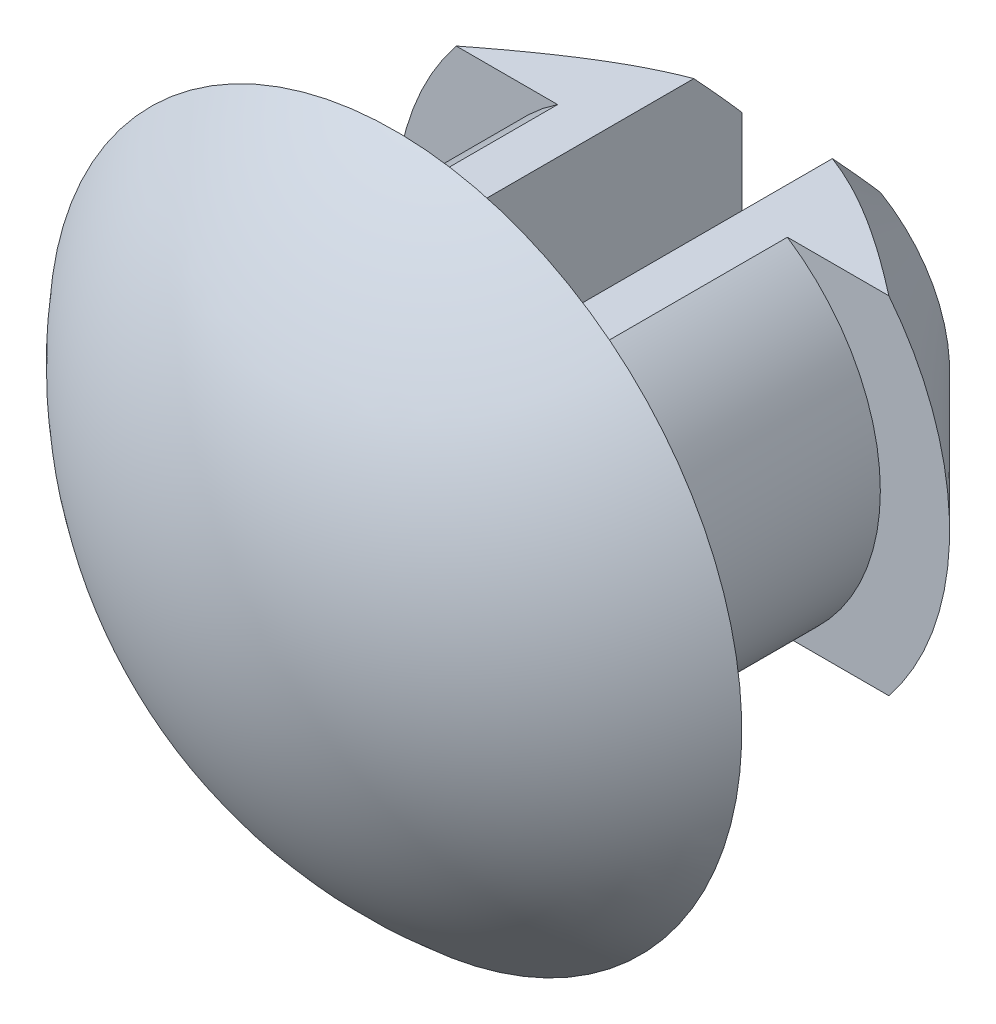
ISO-10303-21;
HEADER;
FILE_DESCRIPTION(('STEP AP214'),'2;1');
FILE_NAME('part.step','',(''),(''),'','','');
FILE_SCHEMA(('AUTOMOTIVE_DESIGN { 1 0 10303 214 1 1 1 1 }'));
ENDSEC;
DATA;
#1=APPLICATION_CONTEXT('core data for automotive mechanical design processes');
#2=APPLICATION_PROTOCOL_DEFINITION('international standard','automotive_design',2000,#1);
#3=PRODUCT_CONTEXT('',#1,'mechanical');
#4=PRODUCT('Part','Part','',(#3));
#5=PRODUCT_RELATED_PRODUCT_CATEGORY('part','',(#4));
#6=PRODUCT_DEFINITION_FORMATION('','',#4);
#7=PRODUCT_DEFINITION_CONTEXT('part definition',#1,'design');
#8=PRODUCT_DEFINITION('design','',#6,#7);
#9=PRODUCT_DEFINITION_SHAPE('','',#8);
#10=(LENGTH_UNIT() NAMED_UNIT(*) SI_UNIT(.MILLI.,.METRE.));
#11=(NAMED_UNIT(*) PLANE_ANGLE_UNIT() SI_UNIT($,.RADIAN.));
#12=(NAMED_UNIT(*) SI_UNIT($,.STERADIAN.) SOLID_ANGLE_UNIT());
#13=UNCERTAINTY_MEASURE_WITH_UNIT(LENGTH_MEASURE(1.E-05),#10,'distance_accuracy_value','');
#14=(GEOMETRIC_REPRESENTATION_CONTEXT(3) GLOBAL_UNCERTAINTY_ASSIGNED_CONTEXT((#13)) GLOBAL_UNIT_ASSIGNED_CONTEXT((#10,
#11,#12)) REPRESENTATION_CONTEXT('',''));
#15=CARTESIAN_POINT('',(0.,0.,0.));
#16=DIRECTION('',(0.,0.,1.));
#17=DIRECTION('',(1.,0.,0.));
#18=AXIS2_PLACEMENT_3D('',#15,#16,#17);
#19=CARTESIAN_POINT('',(-1.,0.,-3.));
#20=DIRECTION('',(0.,0.,-1.));
#21=DIRECTION('',(-1.,0.,0.));
#22=AXIS2_PLACEMENT_3D('',#19,#20,#21);
#23=PLANE('',#22);
#24=DIRECTION('',(0.,1.,0.));
#25=VECTOR('',#24,1.);
#26=CARTESIAN_POINT('',(0.5,-2.5,-3.));
#27=LINE('',#26,#25);
#28=CARTESIAN_POINT('',(0.5,-0.866025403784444,-3.));
#29=VERTEX_POINT('',#28);
#30=CARTESIAN_POINT('',(0.5,0.866025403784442,-3.));
#31=VERTEX_POINT('',#30);
#32=EDGE_CURVE('E175',#29,#31,#27,.T.);
#33=ORIENTED_EDGE('',*,*,#32,.T.);
#34=CARTESIAN_POINT('',(0.,0.,-3.));
#35=DIRECTION('',(0.,0.,-1.));
#36=DIRECTION('',(-1.,0.,0.));
#37=AXIS2_PLACEMENT_3D('',#34,#35,#36);
#38=CIRCLE('',#37,1.);
#39=EDGE_CURVE('E168',#31,#29,#38,.T.);
#40=ORIENTED_EDGE('',*,*,#39,.T.);
#41=EDGE_LOOP('',(#33,#40));
#42=FACE_BOUND('',#41,.T.);
#43=ADVANCED_FACE('F33',(#42),#23,.T.);
#44=CARTESIAN_POINT('',(0.,0.,-3.));
#45=DIRECTION('',(0.,0.,1.));
#46=DIRECTION('',(1.,0.,0.));
#47=AXIS2_PLACEMENT_3D('',#44,#45,#46);
#48=CONICAL_SURFACE('',#47,1.,0.785398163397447);
#49=CARTESIAN_POINT('',(-0.581865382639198,-1.25,-2.62120802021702));
#50=CARTESIAN_POINT('',(-0.539130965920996,-1.25,-2.63924413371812));
#51=CARTESIAN_POINT('',(-0.495759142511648,-1.25,-2.65591424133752));
#52=CARTESIAN_POINT('',(-0.407710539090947,-1.25,-2.68584245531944));
#53=CARTESIAN_POINT('',(-0.363030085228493,-1.25,-2.69908967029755));
#54=CARTESIAN_POINT('',(-0.273411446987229,-1.25,-2.72117059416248));
#55=CARTESIAN_POINT('',(-0.228492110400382,-1.25,-2.73007888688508));
#56=CARTESIAN_POINT('',(-0.138017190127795,-1.25,-2.74319812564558));
#57=CARTESIAN_POINT('',(-0.0924625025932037,-1.25,-2.74741512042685));
#58=CARTESIAN_POINT('',(-0.0035039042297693,-1.25,-2.7507447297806));
#59=CARTESIAN_POINT('',(0.0398905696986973,-1.25,-2.75010788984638));
#60=CARTESIAN_POINT('',(0.126393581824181,-1.25,-2.74436812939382));
#61=CARTESIAN_POINT('',(0.169502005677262,-1.25,-2.7392635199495));
#62=CARTESIAN_POINT('',(0.255061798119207,-1.25,-2.72494184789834));
#63=CARTESIAN_POINT('',(0.2975124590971,-1.25,-2.71572063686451));
#64=CARTESIAN_POINT('',(0.381464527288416,-1.25,-2.69371769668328));
#65=CARTESIAN_POINT('',(0.422965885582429,-1.25,-2.68093578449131));
#66=CARTESIAN_POINT('',(0.544817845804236,-1.25,-2.63854295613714));
#67=CARTESIAN_POINT('',(0.623676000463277,-1.25,-2.60465885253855));
#68=CARTESIAN_POINT('',(0.77771680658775,-1.25,-2.5293506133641));
#69=CARTESIAN_POINT('',(0.85289211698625,-1.25,-2.48791213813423));
#70=CARTESIAN_POINT('',(1.00139418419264,-1.25,-2.39947204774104));
#71=CARTESIAN_POINT('',(1.07467603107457,-1.25,-2.35239602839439));
#72=CARTESIAN_POINT('',(1.21896140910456,-1.25,-2.25485100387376));
#73=CARTESIAN_POINT('',(1.28996390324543,-1.25,-2.20438048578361));
#74=CARTESIAN_POINT('',(1.42599167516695,-1.25,-2.10422332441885));
#75=CARTESIAN_POINT('',(1.49111871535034,-1.25,-2.05467393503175));
#76=CARTESIAN_POINT('',(1.6201907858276,-1.25,-1.95405473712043));
#77=CARTESIAN_POINT('',(1.68413571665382,-1.25,-1.90298480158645));
#78=CARTESIAN_POINT('',(1.87468062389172,-1.25,-1.74802029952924));
#79=CARTESIAN_POINT('',(1.99990378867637,-1.25,-1.6424367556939));
#80=CARTESIAN_POINT('',(2.24122515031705,-1.25,-1.43443853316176));
#81=CARTESIAN_POINT('',(2.35744771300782,-1.25,-1.33216659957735));
#82=CARTESIAN_POINT('',(2.5306113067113,-1.25,-1.17762119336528));
#83=CARTESIAN_POINT('',(2.58809548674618,-1.25,-1.12595500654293));
#84=CARTESIAN_POINT('',(2.70275638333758,-1.25,-1.02228342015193));
#85=CARTESIAN_POINT('',(2.75993310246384,-1.25,-0.970278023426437));
#86=CARTESIAN_POINT('',(2.81698318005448,-1.25,-0.918134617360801));
#87=B_SPLINE_CURVE_WITH_KNOTS('',3,(#49,#50,#51,#52,#53,#54,#55,#56,#57,#58,#59,#60,#61,#62,#63,
#64,#65,#66,#67,#68,#69,#70,#71,#72,#73,#74,#75,#76,#77,#78,#79,#80,#81,#82,#83,#84,#85,#86),
.UNSPECIFIED.,.F.,.F.,(4,2,2,2,2,2,2,2,2,2,2,2,2,2,2,2,2,2,4),(0.,0.139214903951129,
0.278867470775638,0.416026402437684,0.553008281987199,0.682969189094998,0.812979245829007,
0.943120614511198,1.07326867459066,1.33005769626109,1.58733932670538,1.84849691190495,
2.10977167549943,2.35524208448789,2.60073305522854,3.09204169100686,3.55646598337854,
3.78833627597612,4.0202046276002),.UNSPECIFIED.);
#88=CARTESIAN_POINT('',(0.5,-1.25,-2.65370879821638));
#89=VERTEX_POINT('',#88);
#90=CARTESIAN_POINT('',(1.56124949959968,-1.25,-1.99999999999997));
#91=VERTEX_POINT('',#90);
#92=EDGE_CURVE('E183',#89,#91,#87,.T.);
#93=ORIENTED_EDGE('',*,*,#92,.F.);
#94=CARTESIAN_POINT('',(0.5,4.44603678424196,0.474063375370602));
#95=CARTESIAN_POINT('',(0.5,4.32272067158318,0.351522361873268));
#96=CARTESIAN_POINT('',(0.5,4.1993752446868,0.2290108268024));
#97=CARTESIAN_POINT('',(0.5,3.95257998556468,-0.0159496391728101));
#98=CARTESIAN_POINT('',(0.5,3.82913013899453,-0.138398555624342));
#99=CARTESIAN_POINT('',(0.5,3.58165551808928,-0.383650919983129));
#100=CARTESIAN_POINT('',(0.5,3.45763033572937,-0.506453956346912));
#101=CARTESIAN_POINT('',(0.5,3.20945063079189,-0.751886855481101));
#102=CARTESIAN_POINT('',(0.5,3.08529613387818,-0.874516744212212));
#103=CARTESIAN_POINT('',(0.5,2.77363505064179,-1.18183594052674));
#104=CARTESIAN_POINT('',(0.5,2.58599766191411,-1.36639287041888));
#105=CARTESIAN_POINT('',(0.5,2.3038268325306,-1.64261591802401));
#106=CARTESIAN_POINT('',(0.5,2.20962124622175,-1.73461683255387));
#107=CARTESIAN_POINT('',(0.5,2.02089626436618,-1.91828316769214));
#108=CARTESIAN_POINT('',(0.5,1.92637689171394,-2.00994861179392));
#109=CARTESIAN_POINT('',(0.5,1.73718945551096,-2.19245762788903));
#110=CARTESIAN_POINT('',(0.5,1.64252308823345,-2.28330295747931));
#111=CARTESIAN_POINT('',(0.5,1.45240520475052,-2.46422396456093));
#112=CARTESIAN_POINT('',(0.5,1.3569534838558,-2.55429942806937));
#113=CARTESIAN_POINT('',(0.5,1.21282012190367,-2.68827322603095));
#114=CARTESIAN_POINT('',(0.5,1.16464480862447,-2.73271561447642));
#115=CARTESIAN_POINT('',(0.5,1.06782166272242,-2.8210819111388));
#116=CARTESIAN_POINT('',(0.5,1.01917384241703,-2.86500583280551));
#117=CARTESIAN_POINT('',(0.5,0.921222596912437,-2.95207448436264));
#118=CARTESIAN_POINT('',(0.5,0.871919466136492,-2.99521954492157));
#119=CARTESIAN_POINT('',(0.5,0.772311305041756,-3.08033382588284));
#120=CARTESIAN_POINT('',(0.5,0.722006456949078,-3.12230325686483));
#121=CARTESIAN_POINT('',(0.5,0.651493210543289,-3.17883488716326));
#122=CARTESIAN_POINT('',(0.5,0.631969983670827,-3.19425057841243));
#123=CARTESIAN_POINT('',(0.5,0.592637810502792,-3.22471676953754));
#124=CARTESIAN_POINT('',(0.5,0.572828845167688,-3.23976724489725));
#125=CARTESIAN_POINT('',(0.5,0.532816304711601,-3.26944397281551));
#126=CARTESIAN_POINT('',(0.5,0.512611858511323,-3.28406905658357));
#127=CARTESIAN_POINT('',(0.5,0.471778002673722,-3.31271200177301));
#128=CARTESIAN_POINT('',(0.5,0.451148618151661,-3.32672989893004));
#129=CARTESIAN_POINT('',(0.5,0.389725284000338,-3.36681225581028));
#130=CARTESIAN_POINT('',(0.5,0.348219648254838,-3.39180283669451));
#131=CARTESIAN_POINT('',(0.5,0.262471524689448,-3.43647040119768));
#132=CARTESIAN_POINT('',(0.5,0.218243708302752,-3.45617324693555));
#133=CARTESIAN_POINT('',(0.5,0.157915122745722,-3.47583301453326));
#134=CARTESIAN_POINT('',(0.5,0.143227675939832,-3.48008694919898));
#135=CARTESIAN_POINT('',(0.5,0.113571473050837,-3.48746653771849));
#136=CARTESIAN_POINT('',(0.5,0.0986026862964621,-3.49059206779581));
#137=CARTESIAN_POINT('',(0.5,0.0535018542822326,-3.49800886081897));
#138=CARTESIAN_POINT('',(0.5,0.0230197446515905,-3.50039411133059));
#139=CARTESIAN_POINT('',(0.5,-0.0379114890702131,-3.49949501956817));
#140=CARTESIAN_POINT('',(0.5,-0.0683603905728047,-3.49619810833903));
#141=CARTESIAN_POINT('',(0.5,-0.128387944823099,-3.4846307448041));
#142=CARTESIAN_POINT('',(0.5,-0.157961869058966,-3.47633713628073));
#143=CARTESIAN_POINT('',(0.5,-0.219675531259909,-3.45474025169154));
#144=CARTESIAN_POINT('',(0.5,-0.251624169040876,-3.44091259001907));
#145=CARTESIAN_POINT('',(0.5,-0.314035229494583,-3.41018769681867));
#146=CARTESIAN_POINT('',(0.5,-0.344494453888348,-3.39328419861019));
#147=CARTESIAN_POINT('',(0.5,-0.404423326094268,-3.3573648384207));
#148=CARTESIAN_POINT('',(0.5,-0.433884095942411,-3.3383344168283));
#149=CARTESIAN_POINT('',(0.5,-0.491854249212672,-3.29895083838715));
#150=CARTESIAN_POINT('',(0.5,-0.520364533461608,-3.27859899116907));
#151=CARTESIAN_POINT('',(0.5,-0.57953638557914,-3.23486869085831));
#152=CARTESIAN_POINT('',(0.5,-0.610124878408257,-3.21139201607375));
#153=CARTESIAN_POINT('',(0.5,-0.670685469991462,-3.16365409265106));
#154=CARTESIAN_POINT('',(0.5,-0.700657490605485,-3.13939274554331));
#155=CARTESIAN_POINT('',(0.5,-0.789910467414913,-3.06575429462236));
#156=CARTESIAN_POINT('',(0.5,-0.848501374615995,-3.01554338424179));
#157=CARTESIAN_POINT('',(0.5,-0.964681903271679,-2.9137964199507));
#158=CARTESIAN_POINT('',(0.5,-1.02226967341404,-2.86225827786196));
#159=CARTESIAN_POINT('',(0.5,-1.13671607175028,-2.7584099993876));
#160=CARTESIAN_POINT('',(0.5,-1.19357488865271,-2.7061000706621));
#161=CARTESIAN_POINT('',(0.5,-1.30660824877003,-2.60114748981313));
#162=CARTESIAN_POINT('',(0.5,-1.36278450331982,-2.54850667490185));
#163=CARTESIAN_POINT('',(0.5,-1.47479874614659,-2.44285929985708));
#164=CARTESIAN_POINT('',(0.5,-1.53063671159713,-2.38985271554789));
#165=CARTESIAN_POINT('',(0.5,-1.69767409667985,-2.2305469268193));
#166=CARTESIAN_POINT('',(0.5,-1.80850445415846,-2.12386109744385));
#167=CARTESIAN_POINT('',(0.5,-2.02526052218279,-1.91410009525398));
#168=CARTESIAN_POINT('',(0.5,-2.13120809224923,-1.81104744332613));
#169=CARTESIAN_POINT('',(0.5,-2.34276011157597,-1.60458875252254));
#170=CARTESIAN_POINT('',(0.5,-2.44836455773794,-1.50118271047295));
#171=CARTESIAN_POINT('',(0.5,-2.76491471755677,-1.19053612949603));
#172=CARTESIAN_POINT('',(0.5,-2.97551665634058,-0.982945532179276));
#173=CARTESIAN_POINT('',(0.5,-3.39630757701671,-0.567237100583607));
#174=CARTESIAN_POINT('',(0.5,-3.60649643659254,-0.359119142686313));
#175=CARTESIAN_POINT('',(0.5,-4.02649035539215,0.0573323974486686));
#176=CARTESIAN_POINT('',(0.5,-4.23629553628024,0.265665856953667));
#177=CARTESIAN_POINT('',(0.5,-4.44603678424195,0.474063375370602));
#178=B_SPLINE_CURVE_WITH_KNOTS('',3,(#94,#95,#96,#97,#98,#99,#100,#101,#102,#103,#104,#105,#106,
#107,#108,#109,#110,#111,#112,#113,#114,#115,#116,#117,#118,#119,#120,#121,#122,#123,#124,#125,
#126,#127,#128,#129,#130,#131,#132,#133,#134,#135,#136,#137,#138,#139,#140,#141,#142,#143,#144,
#145,#146,#147,#148,#149,#150,#151,#152,#153,#154,#155,#156,#157,#158,#159,#160,#161,#162,#163,
#164,#165,#166,#167,#168,#169,#170,#171,#172,#173,#174,#175,#176,#177),.UNSPECIFIED.,.F.,.F.,(4,
2,2,2,2,2,2,2,2,2,2,2,2,2,2,2,2,2,2,2,2,2,2,2,2,2,2,2,2,2,2,2,2,2,2,2,2,2,2,2,2,4),(0.,
0.521544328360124,1.04317866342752,1.56678666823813,2.09030537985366,2.87987371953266,
3.27490459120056,3.66990724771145,4.06351864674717,4.45723610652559,4.65386510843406,
4.85048899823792,5.04702734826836,5.24353026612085,5.31815399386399,5.3927827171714,
5.46760012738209,5.5424131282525,5.68761009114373,5.83208339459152,5.87791587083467,
5.9237533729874,6.01494038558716,6.10632936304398,6.19814515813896,6.30233063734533,
6.40673080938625,6.51189534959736,6.61695720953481,6.73261636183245,6.84829008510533,
7.07973925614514,7.31157799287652,7.54335544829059,7.77431114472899,8.00528225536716,
8.46678294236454,8.9101810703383,9.35358319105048,10.2407247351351,11.1280981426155,
12.0151092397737),.UNSPECIFIED.);
#179=EDGE_CURVE('E155',#29,#89,#178,.T.);
#180=ORIENTED_EDGE('',*,*,#179,.F.);
#181=ORIENTED_EDGE('',*,*,#39,.F.);
#182=CARTESIAN_POINT('',(0.5,1.25,-2.65370879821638));
#183=VERTEX_POINT('',#182);
#184=EDGE_CURVE('E181',#183,#31,#178,.T.);
#185=ORIENTED_EDGE('',*,*,#184,.F.);
#186=CARTESIAN_POINT('',(2.81698318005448,1.25,-0.918134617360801));
#187=CARTESIAN_POINT('',(2.73518486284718,1.25,-0.992880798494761));
#188=CARTESIAN_POINT('',(2.65313828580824,1.25,-1.06735942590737));
#189=CARTESIAN_POINT('',(2.48834532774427,1.25,-1.21557369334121));
#190=CARTESIAN_POINT('',(2.40559879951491,1.25,-1.28930916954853));
#191=CARTESIAN_POINT('',(2.23884641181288,1.25,-1.43614143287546));
#192=CARTESIAN_POINT('',(2.15483645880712,1.25,-1.50923358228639));
#193=CARTESIAN_POINT('',(1.98566373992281,1.25,-1.65405866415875));
#194=CARTESIAN_POINT('',(1.90050109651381,1.25,-1.72579173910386));
#195=CARTESIAN_POINT('',(1.74436661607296,1.25,-1.85436897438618));
#196=CARTESIAN_POINT('',(1.67365708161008,1.25,-1.91153070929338));
#197=CARTESIAN_POINT('',(1.53086849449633,1.25,-2.02411397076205));
#198=CARTESIAN_POINT('',(1.45878955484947,1.25,-2.07953563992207));
#199=CARTESIAN_POINT('',(1.31281586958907,1.25,-2.18793215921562));
#200=CARTESIAN_POINT('',(1.2389213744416,1.25,-2.24090734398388));
#201=CARTESIAN_POINT('',(1.08870639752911,1.25,-2.34326903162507));
#202=CARTESIAN_POINT('',(1.0123869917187,1.25,-2.39265709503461));
#203=CARTESIAN_POINT('',(0.849758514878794,1.25,-2.4900438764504));
#204=CARTESIAN_POINT('',(0.763154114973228,1.25,-2.53755997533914));
#205=CARTESIAN_POINT('',(0.584966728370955,1.25,-2.62211790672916));
#206=CARTESIAN_POINT('',(0.493395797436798,1.25,-2.65918385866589));
#207=CARTESIAN_POINT('',(0.32691010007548,1.25,-2.70976682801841));
#208=CARTESIAN_POINT('',(0.253111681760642,1.25,-2.72676467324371));
#209=CARTESIAN_POINT('',(0.141126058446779,1.25,-2.7426064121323));
#210=CARTESIAN_POINT('',(0.103602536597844,1.25,-2.74627841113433));
#211=CARTESIAN_POINT('',(0.0283722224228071,1.25,-2.75024054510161));
#212=CARTESIAN_POINT('',(-0.00933455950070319,1.25,-2.75053086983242));
#213=CARTESIAN_POINT('',(-0.0846347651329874,1.25,-2.74770370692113));
#214=CARTESIAN_POINT('',(-0.122228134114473,1.25,-2.74458477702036));
#215=CARTESIAN_POINT('',(-0.197011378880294,1.25,-2.73511487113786));
#216=CARTESIAN_POINT('',(-0.23420103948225,1.25,-2.72876225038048));
#217=CARTESIAN_POINT('',(-0.344934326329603,1.25,-2.70528692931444));
#218=CARTESIAN_POINT('',(-0.417572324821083,1.25,-2.68375034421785));
#219=CARTESIAN_POINT('',(-0.504239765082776,1.25,-2.65220907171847));
#220=CARTESIAN_POINT('',(-0.519899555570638,1.25,-2.64626851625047));
#221=CARTESIAN_POINT('',(-0.551017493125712,1.25,-2.63401397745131));
#222=CARTESIAN_POINT('',(-0.566476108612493,1.25,-2.62770118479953));
#223=CARTESIAN_POINT('',(-0.581865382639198,1.25,-2.62120802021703));
#224=B_SPLINE_CURVE_WITH_KNOTS('',3,(#186,#187,#188,#189,#190,#191,#192,#193,#194,#195,#196,
#197,#198,#199,#200,#201,#202,#203,#204,#205,#206,#207,#208,#209,#210,#211,#212,#213,#214,#215,
#216,#217,#218,#219,#220,#221,#222,#223),.UNSPECIFIED.,.F.,.F.,(4,2,2,2,2,2,2,2,2,2,2,2,2,2,2,2,
2,2,4),(0.,0.332421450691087,0.664914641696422,0.998972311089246,1.3329947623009,
1.60574959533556,1.87848201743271,2.15117702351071,2.42375267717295,2.71971079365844,
3.01498012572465,3.24115831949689,3.35413093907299,3.46709721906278,3.5801113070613,
3.69318293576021,3.91953377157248,3.96978161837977,4.01987664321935),.UNSPECIFIED.);
#225=CARTESIAN_POINT('',(1.56124949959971,1.25,-1.99999999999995));
#226=VERTEX_POINT('',#225);
#227=EDGE_CURVE('E48',#226,#183,#224,.T.);
#228=ORIENTED_EDGE('',*,*,#227,.F.);
#229=CARTESIAN_POINT('',(0.,0.,-2.));
#230=DIRECTION('',(0.,0.,-1.));
#231=DIRECTION('',(-1.,0.,0.));
#232=AXIS2_PLACEMENT_3D('',#229,#230,#231);
#233=CIRCLE('',#232,2.);
#234=EDGE_CURVE('E163',#226,#91,#233,.T.);
#235=ORIENTED_EDGE('',*,*,#234,.T.);
#236=EDGE_LOOP('',(#93,#180,#181,#185,#228,#235));
#237=FACE_BOUND('',#236,.T.);
#238=ADVANCED_FACE('F180',(#237),#48,.T.);
#239=CARTESIAN_POINT('',(-1.5,0.,-2.));
#240=DIRECTION('',(0.,0.,1.));
#241=DIRECTION('',(1.,0.,0.));
#242=AXIS2_PLACEMENT_3D('',#239,#240,#241);
#243=PLANE('',#242);
#244=DIRECTION('',(-1.,0.,0.));
#245=VECTOR('',#244,1.);
#246=CARTESIAN_POINT('',(-1.5,-1.25,-2.));
#247=LINE('',#246,#245);
#248=CARTESIAN_POINT('',(0.829156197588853,-1.25,-2.));
#249=VERTEX_POINT('',#248);
#250=EDGE_CURVE('E257',#91,#249,#247,.T.);
#251=ORIENTED_EDGE('',*,*,#250,.F.);
#252=ORIENTED_EDGE('',*,*,#234,.F.);
#253=DIRECTION('',(1.,0.,0.));
#254=VECTOR('',#253,1.);
#255=CARTESIAN_POINT('',(-1.5,1.25,-2.));
#256=LINE('',#255,#254);
#257=CARTESIAN_POINT('',(0.829156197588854,1.25,-2.));
#258=VERTEX_POINT('',#257);
#259=EDGE_CURVE('E277',#258,#226,#256,.T.);
#260=ORIENTED_EDGE('',*,*,#259,.F.);
#261=CARTESIAN_POINT('',(0.,0.,-2.));
#262=DIRECTION('',(0.,0.,-1.));
#263=DIRECTION('',(-1.,0.,0.));
#264=AXIS2_PLACEMENT_3D('',#261,#262,#263);
#265=CIRCLE('',#264,1.5);
#266=EDGE_CURVE('E159',#258,#249,#265,.T.);
#267=ORIENTED_EDGE('',*,*,#266,.T.);
#268=EDGE_LOOP('',(#251,#252,#260,#267));
#269=FACE_BOUND('',#268,.T.);
#270=ADVANCED_FACE('F222',(#269),#243,.T.);
#271=CARTESIAN_POINT('',(0.,0.,0.));
#272=DIRECTION('',(0.,0.,-1.));
#273=DIRECTION('',(-1.,0.,0.));
#274=AXIS2_PLACEMENT_3D('',#271,#272,#273);
#275=CYLINDRICAL_SURFACE('',#274,1.5);
#276=DIRECTION('',(0.,0.,-1.));
#277=VECTOR('',#276,1.);
#278=CARTESIAN_POINT('',(0.829156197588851,-1.25,0.));
#279=LINE('',#278,#277);
#280=CARTESIAN_POINT('',(0.82915619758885,-1.25,0.));
#281=VERTEX_POINT('',#280);
#282=EDGE_CURVE('E245',#249,#281,#279,.F.);
#283=ORIENTED_EDGE('',*,*,#282,.F.);
#284=ORIENTED_EDGE('',*,*,#266,.F.);
#285=DIRECTION('',(0.,0.,-1.));
#286=VECTOR('',#285,1.);
#287=CARTESIAN_POINT('',(0.829156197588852,1.25,0.));
#288=LINE('',#287,#286);
#289=CARTESIAN_POINT('',(0.829156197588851,1.25,0.));
#290=VERTEX_POINT('',#289);
#291=EDGE_CURVE('E275',#290,#258,#288,.T.);
#292=ORIENTED_EDGE('',*,*,#291,.F.);
#293=CARTESIAN_POINT('',(0.,0.,0.));
#294=DIRECTION('',(0.,0.,-1.));
#295=DIRECTION('',(-1.,0.,0.));
#296=AXIS2_PLACEMENT_3D('',#293,#294,#295);
#297=CIRCLE('',#296,1.5);
#298=EDGE_CURVE('E149',#290,#281,#297,.T.);
#299=ORIENTED_EDGE('',*,*,#298,.T.);
#300=EDGE_LOOP('',(#283,#284,#292,#299));
#301=FACE_BOUND('',#300,.T.);
#302=ADVANCED_FACE('F219',(#301),#275,.T.);
#303=CARTESIAN_POINT('',(0.,0.,-2.07665596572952));
#304=DIRECTION('',(0.,0.,-1.));
#305=DIRECTION('',(-1.,0.,0.));
#306=AXIS2_PLACEMENT_3D('',#303,#304,#305);
#307=SPHERICAL_SURFACE('',#306,3.25);
#308=CARTESIAN_POINT('',(0.,0.,0.));
#309=DIRECTION('',(0.,0.,-1.));
#310=DIRECTION('',(-1.,0.,0.));
#311=AXIS2_PLACEMENT_3D('',#308,#309,#310);
#312=CIRCLE('',#311,2.5);
#313=CARTESIAN_POINT('',(-2.5,0.,0.));
#314=VERTEX_POINT('',#313);
#315=EDGE_CURVE('E150',#314,#314,#312,.T.);
#316=ORIENTED_EDGE('',*,*,#315,.F.);
#317=EDGE_LOOP('',(#316));
#318=FACE_BOUND('',#317,.T.);
#319=ADVANCED_FACE('F35',(#318),#307,.T.);
#320=DIRECTION('',(0.,1.,0.));
#321=VECTOR('',#320,1.);
#322=CARTESIAN_POINT('',(-0.5,-2.5,-3.));
#323=LINE('',#322,#321);
#324=CARTESIAN_POINT('',(-0.5,-0.86602540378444,-3.));
#325=VERTEX_POINT('',#324);
#326=CARTESIAN_POINT('',(-0.5,0.866025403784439,-3.));
#327=VERTEX_POINT('',#326);
#328=EDGE_CURVE('E242',#325,#327,#323,.T.);
#329=ORIENTED_EDGE('',*,*,#328,.F.);
#330=EDGE_CURVE('E166',#325,#327,#38,.T.);
#331=ORIENTED_EDGE('',*,*,#330,.T.);
#332=EDGE_LOOP('',(#329,#331));
#333=FACE_BOUND('',#332,.T.);
#334=ADVANCED_FACE('F226',(#333),#23,.T.);
#335=CARTESIAN_POINT('',(-2.81698318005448,-1.25,-0.918134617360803));
#336=CARTESIAN_POINT('',(-2.73518486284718,-1.25,-0.992880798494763));
#337=CARTESIAN_POINT('',(-2.65313828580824,-1.25,-1.06735942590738));
#338=CARTESIAN_POINT('',(-2.48834532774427,-1.25,-1.21557369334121));
#339=CARTESIAN_POINT('',(-2.40559879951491,-1.25,-1.28930916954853));
#340=CARTESIAN_POINT('',(-2.23884641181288,-1.25,-1.43614143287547));
#341=CARTESIAN_POINT('',(-2.15483645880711,-1.25,-1.50923358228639));
#342=CARTESIAN_POINT('',(-1.9856637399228,-1.25,-1.65405866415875));
#343=CARTESIAN_POINT('',(-1.9005010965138,-1.25,-1.72579173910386));
#344=CARTESIAN_POINT('',(-1.74436661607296,-1.25,-1.85436897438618));
#345=CARTESIAN_POINT('',(-1.67365708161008,-1.25,-1.91153070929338));
#346=CARTESIAN_POINT('',(-1.53086849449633,-1.25,-2.02411397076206));
#347=CARTESIAN_POINT('',(-1.45878955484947,-1.25,-2.07953563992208));
#348=CARTESIAN_POINT('',(-1.31281586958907,-1.25,-2.18793215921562));
#349=CARTESIAN_POINT('',(-1.2389213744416,-1.25,-2.24090734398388));
#350=CARTESIAN_POINT('',(-1.0887063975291,-1.25,-2.34326903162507));
#351=CARTESIAN_POINT('',(-1.0123869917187,-1.25,-2.39265709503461));
#352=CARTESIAN_POINT('',(-0.84975851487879,-1.25,-2.4900438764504));
#353=CARTESIAN_POINT('',(-0.763154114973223,-1.25,-2.53755997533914));
#354=CARTESIAN_POINT('',(-0.584966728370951,-1.25,-2.62211790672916));
#355=CARTESIAN_POINT('',(-0.493395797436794,-1.25,-2.65918385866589));
#356=CARTESIAN_POINT('',(-0.326910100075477,-1.25,-2.70976682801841));
#357=CARTESIAN_POINT('',(-0.253111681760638,-1.25,-2.72676467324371));
#358=CARTESIAN_POINT('',(-0.141126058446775,-1.25,-2.7426064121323));
#359=CARTESIAN_POINT('',(-0.103602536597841,-1.25,-2.74627841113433));
#360=CARTESIAN_POINT('',(-0.0283722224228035,-1.25,-2.75024054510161));
#361=CARTESIAN_POINT('',(0.00933455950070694,-1.25,-2.75053086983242));
#362=CARTESIAN_POINT('',(0.0846347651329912,-1.25,-2.74770370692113));
#363=CARTESIAN_POINT('',(0.122228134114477,-1.25,-2.74458477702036));
#364=CARTESIAN_POINT('',(0.197011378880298,-1.25,-2.73511487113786));
#365=CARTESIAN_POINT('',(0.234201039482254,-1.25,-2.72876225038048));
#366=CARTESIAN_POINT('',(0.344934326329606,-1.25,-2.70528692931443));
#367=CARTESIAN_POINT('',(0.417572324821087,-1.25,-2.68375034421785));
#368=CARTESIAN_POINT('',(0.504239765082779,-1.25,-2.65220907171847));
#369=CARTESIAN_POINT('',(0.519899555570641,-1.25,-2.64626851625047));
#370=CARTESIAN_POINT('',(0.551017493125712,-1.25,-2.63401397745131));
#371=CARTESIAN_POINT('',(0.566476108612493,-1.25,-2.62770118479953));
#372=CARTESIAN_POINT('',(0.581865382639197,-1.25,-2.62120802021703));
#373=B_SPLINE_CURVE_WITH_KNOTS('',3,(#335,#336,#337,#338,#339,#340,#341,#342,#343,#344,#345,
#346,#347,#348,#349,#350,#351,#352,#353,#354,#355,#356,#357,#358,#359,#360,#361,#362,#363,#364,
#365,#366,#367,#368,#369,#370,#371,#372),.UNSPECIFIED.,.F.,.F.,(4,2,2,2,2,2,2,2,2,2,2,2,2,2,2,2,
2,2,4),(0.,0.332421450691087,0.664914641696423,0.998972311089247,1.33299476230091,
1.60574959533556,1.87848201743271,2.15117702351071,2.42375267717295,2.71971079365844,
3.01498012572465,3.24115831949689,3.35413093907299,3.46709721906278,3.5801113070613,
3.69318293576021,3.91953377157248,3.96978161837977,4.01987664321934),.UNSPECIFIED.);
#374=CARTESIAN_POINT('',(-1.56124949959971,-1.25,-1.99999999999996));
#375=VERTEX_POINT('',#374);
#376=CARTESIAN_POINT('',(-0.5,-1.25,-2.65370879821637));
#377=VERTEX_POINT('',#376);
#378=EDGE_CURVE('E269',#375,#377,#373,.T.);
#379=ORIENTED_EDGE('',*,*,#378,.F.);
#380=CARTESIAN_POINT('',(-1.56124949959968,1.25,-1.99999999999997));
#381=VERTEX_POINT('',#380);
#382=EDGE_CURVE('E162',#375,#381,#233,.T.);
#383=ORIENTED_EDGE('',*,*,#382,.T.);
#384=CARTESIAN_POINT('',(0.581865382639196,1.25,-2.62120802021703));
#385=CARTESIAN_POINT('',(0.539130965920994,1.25,-2.63924413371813));
#386=CARTESIAN_POINT('',(0.495759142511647,1.25,-2.65591424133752));
#387=CARTESIAN_POINT('',(0.407710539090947,1.25,-2.68584245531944));
#388=CARTESIAN_POINT('',(0.363030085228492,1.25,-2.69908967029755));
#389=CARTESIAN_POINT('',(0.273411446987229,1.25,-2.72117059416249));
#390=CARTESIAN_POINT('',(0.228492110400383,1.25,-2.73007888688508));
#391=CARTESIAN_POINT('',(0.138017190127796,1.25,-2.74319812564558));
#392=CARTESIAN_POINT('',(0.0924625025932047,1.25,-2.74741512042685));
#393=CARTESIAN_POINT('',(0.00350390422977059,1.25,-2.7507447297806));
#394=CARTESIAN_POINT('',(-0.0398905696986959,1.25,-2.75010788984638));
#395=CARTESIAN_POINT('',(-0.126393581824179,1.25,-2.74436812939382));
#396=CARTESIAN_POINT('',(-0.169502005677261,1.25,-2.7392635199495));
#397=CARTESIAN_POINT('',(-0.255061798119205,1.25,-2.72494184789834));
#398=CARTESIAN_POINT('',(-0.297512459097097,1.25,-2.71572063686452));
#399=CARTESIAN_POINT('',(-0.381464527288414,1.25,-2.69371769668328));
#400=CARTESIAN_POINT('',(-0.422965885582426,1.25,-2.68093578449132));
#401=CARTESIAN_POINT('',(-0.544817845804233,1.25,-2.63854295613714));
#402=CARTESIAN_POINT('',(-0.623676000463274,1.25,-2.60465885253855));
#403=CARTESIAN_POINT('',(-0.777716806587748,1.25,-2.5293506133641));
#404=CARTESIAN_POINT('',(-0.852892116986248,1.25,-2.48791213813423));
#405=CARTESIAN_POINT('',(-1.00139418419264,1.25,-2.39947204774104));
#406=CARTESIAN_POINT('',(-1.07467603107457,1.25,-2.35239602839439));
#407=CARTESIAN_POINT('',(-1.21896140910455,1.25,-2.25485100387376));
#408=CARTESIAN_POINT('',(-1.28996390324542,1.25,-2.20438048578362));
#409=CARTESIAN_POINT('',(-1.42599167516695,1.25,-2.10422332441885));
#410=CARTESIAN_POINT('',(-1.49111871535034,1.25,-2.05467393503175));
#411=CARTESIAN_POINT('',(-1.6201907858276,1.25,-1.95405473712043));
#412=CARTESIAN_POINT('',(-1.68413571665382,1.25,-1.90298480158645));
#413=CARTESIAN_POINT('',(-1.87468062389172,1.25,-1.74802029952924));
#414=CARTESIAN_POINT('',(-1.99990378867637,1.25,-1.6424367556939));
#415=CARTESIAN_POINT('',(-2.24122515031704,1.25,-1.43443853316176));
#416=CARTESIAN_POINT('',(-2.35744771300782,1.25,-1.33216659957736));
#417=CARTESIAN_POINT('',(-2.5306113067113,1.25,-1.17762119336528));
#418=CARTESIAN_POINT('',(-2.58809548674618,1.25,-1.12595500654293));
#419=CARTESIAN_POINT('',(-2.70275638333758,1.25,-1.02228342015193));
#420=CARTESIAN_POINT('',(-2.75993310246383,1.25,-0.970278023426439));
#421=CARTESIAN_POINT('',(-2.81698318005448,1.25,-0.918134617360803));
#422=B_SPLINE_CURVE_WITH_KNOTS('',3,(#384,#385,#386,#387,#388,#389,#390,#391,#392,#393,#394,
#395,#396,#397,#398,#399,#400,#401,#402,#403,#404,#405,#406,#407,#408,#409,#410,#411,#412,#413,
#414,#415,#416,#417,#418,#419,#420,#421),.UNSPECIFIED.,.F.,.F.,(4,2,2,2,2,2,2,2,2,2,2,2,2,2,2,2,
2,2,4),(0.,0.139214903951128,0.278867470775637,0.416026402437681,0.553008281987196,
0.682969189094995,0.812979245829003,0.943120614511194,1.07326867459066,1.33005769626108,
1.58733932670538,1.84849691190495,2.10977167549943,2.35524208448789,2.60073305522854,
3.09204169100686,3.55646598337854,3.78833627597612,4.02020462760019),.UNSPECIFIED.);
#423=CARTESIAN_POINT('',(-0.5,1.25,-2.65370879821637));
#424=VERTEX_POINT('',#423);
#425=EDGE_CURVE('E143',#424,#381,#422,.T.);
#426=ORIENTED_EDGE('',*,*,#425,.F.);
#427=CARTESIAN_POINT('',(-0.5,-4.44603678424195,0.474063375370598));
#428=CARTESIAN_POINT('',(-0.5,-4.32272067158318,0.351522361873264));
#429=CARTESIAN_POINT('',(-0.5,-4.1993752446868,0.229010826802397));
#430=CARTESIAN_POINT('',(-0.5,-3.95257998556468,-0.0159496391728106));
#431=CARTESIAN_POINT('',(-0.5,-3.82913013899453,-0.138398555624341));
#432=CARTESIAN_POINT('',(-0.5,-3.58165551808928,-0.383650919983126));
#433=CARTESIAN_POINT('',(-0.5,-3.45763033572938,-0.506453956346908));
#434=CARTESIAN_POINT('',(-0.5,-3.2094506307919,-0.751886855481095));
#435=CARTESIAN_POINT('',(-0.5,-3.08529613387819,-0.874516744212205));
#436=CARTESIAN_POINT('',(-0.5,-2.7736350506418,-1.18183594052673));
#437=CARTESIAN_POINT('',(-0.5,-2.58599766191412,-1.36639287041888));
#438=CARTESIAN_POINT('',(-0.5,-2.3038268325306,-1.64261591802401));
#439=CARTESIAN_POINT('',(-0.5,-2.20962124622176,-1.73461683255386));
#440=CARTESIAN_POINT('',(-0.5,-2.02089626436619,-1.91828316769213));
#441=CARTESIAN_POINT('',(-0.5,-1.92637689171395,-2.00994861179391));
#442=CARTESIAN_POINT('',(-0.5,-1.73718945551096,-2.19245762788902));
#443=CARTESIAN_POINT('',(-0.5,-1.64252308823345,-2.2833029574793));
#444=CARTESIAN_POINT('',(-0.5,-1.45240520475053,-2.46422396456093));
#445=CARTESIAN_POINT('',(-0.5,-1.3569534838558,-2.55429942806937));
#446=CARTESIAN_POINT('',(-0.5,-1.21282012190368,-2.68827322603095));
#447=CARTESIAN_POINT('',(-0.5,-1.16464480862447,-2.73271561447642));
#448=CARTESIAN_POINT('',(-0.5,-1.06782166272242,-2.8210819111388));
#449=CARTESIAN_POINT('',(-0.5,-1.01917384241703,-2.86500583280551));
#450=CARTESIAN_POINT('',(-0.5,-0.921222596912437,-2.95207448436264));
#451=CARTESIAN_POINT('',(-0.5,-0.871919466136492,-2.99521954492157));
#452=CARTESIAN_POINT('',(-0.5,-0.772311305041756,-3.08033382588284));
#453=CARTESIAN_POINT('',(-0.5,-0.722006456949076,-3.12230325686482));
#454=CARTESIAN_POINT('',(-0.5,-0.651493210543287,-3.17883488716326));
#455=CARTESIAN_POINT('',(-0.5,-0.631969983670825,-3.19425057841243));
#456=CARTESIAN_POINT('',(-0.5,-0.59263781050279,-3.22471676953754));
#457=CARTESIAN_POINT('',(-0.5,-0.572828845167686,-3.23976724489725));
#458=CARTESIAN_POINT('',(-0.5,-0.532816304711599,-3.2694439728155));
#459=CARTESIAN_POINT('',(-0.5,-0.512611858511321,-3.28406905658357));
#460=CARTESIAN_POINT('',(-0.5,-0.47177800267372,-3.31271200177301));
#461=CARTESIAN_POINT('',(-0.5,-0.451148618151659,-3.32672989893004));
#462=CARTESIAN_POINT('',(-0.5,-0.389725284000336,-3.36681225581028));
#463=CARTESIAN_POINT('',(-0.5,-0.348219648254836,-3.3918028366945));
#464=CARTESIAN_POINT('',(-0.5,-0.262471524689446,-3.43647040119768));
#465=CARTESIAN_POINT('',(-0.5,-0.21824370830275,-3.45617324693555));
#466=CARTESIAN_POINT('',(-0.5,-0.157915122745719,-3.47583301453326));
#467=CARTESIAN_POINT('',(-0.5,-0.143227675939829,-3.48008694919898));
#468=CARTESIAN_POINT('',(-0.5,-0.113571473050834,-3.48746653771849));
#469=CARTESIAN_POINT('',(-0.5,-0.0986026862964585,-3.49059206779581));
#470=CARTESIAN_POINT('',(-0.5,-0.053501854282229,-3.49800886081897));
#471=CARTESIAN_POINT('',(-0.5,-0.0230197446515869,-3.50039411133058));
#472=CARTESIAN_POINT('',(-0.5,0.0379114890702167,-3.49949501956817));
#473=CARTESIAN_POINT('',(-0.5,0.0683603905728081,-3.49619810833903));
#474=CARTESIAN_POINT('',(-0.5,0.128387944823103,-3.4846307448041));
#475=CARTESIAN_POINT('',(-0.5,0.15796186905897,-3.47633713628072));
#476=CARTESIAN_POINT('',(-0.5,0.219675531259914,-3.45474025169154));
#477=CARTESIAN_POINT('',(-0.5,0.251624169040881,-3.44091259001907));
#478=CARTESIAN_POINT('',(-0.5,0.31403522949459,-3.41018769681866));
#479=CARTESIAN_POINT('',(-0.5,0.344494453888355,-3.39328419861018));
#480=CARTESIAN_POINT('',(-0.5,0.404423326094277,-3.3573648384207));
#481=CARTESIAN_POINT('',(-0.5,0.433884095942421,-3.3383344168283));
#482=CARTESIAN_POINT('',(-0.5,0.491854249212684,-3.29895083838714));
#483=CARTESIAN_POINT('',(-0.5,0.52036453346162,-3.27859899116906));
#484=CARTESIAN_POINT('',(-0.5,0.579536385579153,-3.23486869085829));
#485=CARTESIAN_POINT('',(-0.5,0.610124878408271,-3.21139201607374));
#486=CARTESIAN_POINT('',(-0.5,0.670685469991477,-3.16365409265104));
#487=CARTESIAN_POINT('',(-0.5,0.700657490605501,-3.1393927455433));
#488=CARTESIAN_POINT('',(-0.5,0.789910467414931,-3.06575429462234));
#489=CARTESIAN_POINT('',(-0.5,0.848501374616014,-3.01554338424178));
#490=CARTESIAN_POINT('',(-0.5,0.964681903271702,-2.91379641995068));
#491=CARTESIAN_POINT('',(-0.5,1.02226967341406,-2.86225827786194));
#492=CARTESIAN_POINT('',(-0.5,1.1367160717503,-2.75840999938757));
#493=CARTESIAN_POINT('',(-0.5,1.19357488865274,-2.70610007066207));
#494=CARTESIAN_POINT('',(-0.5,1.30660824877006,-2.6011474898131));
#495=CARTESIAN_POINT('',(-0.5,1.36278450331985,-2.54850667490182));
#496=CARTESIAN_POINT('',(-0.5,1.47479874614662,-2.44285929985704));
#497=CARTESIAN_POINT('',(-0.5,1.53063671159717,-2.38985271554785));
#498=CARTESIAN_POINT('',(-0.5,1.69767409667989,-2.23054692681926));
#499=CARTESIAN_POINT('',(-0.5,1.8085044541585,-2.12386109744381));
#500=CARTESIAN_POINT('',(-0.5,2.02526052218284,-1.91410009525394));
#501=CARTESIAN_POINT('',(-0.5,2.13120809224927,-1.81104744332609));
#502=CARTESIAN_POINT('',(-0.5,2.34276011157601,-1.6045887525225));
#503=CARTESIAN_POINT('',(-0.5,2.44836455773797,-1.50118271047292));
#504=CARTESIAN_POINT('',(-0.5,2.7649147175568,-1.190536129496));
#505=CARTESIAN_POINT('',(-0.5,2.97551665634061,-0.98294553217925));
#506=CARTESIAN_POINT('',(-0.5,3.39630757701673,-0.56723710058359));
#507=CARTESIAN_POINT('',(-0.5,3.60649643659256,-0.359119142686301));
#508=CARTESIAN_POINT('',(-0.5,4.02649035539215,0.0573323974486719));
#509=CARTESIAN_POINT('',(-0.5,4.23629553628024,0.265665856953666));
#510=CARTESIAN_POINT('',(-0.5,4.44603678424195,0.474063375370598));
#511=B_SPLINE_CURVE_WITH_KNOTS('',3,(#427,#428,#429,#430,#431,#432,#433,#434,#435,#436,#437,
#438,#439,#440,#441,#442,#443,#444,#445,#446,#447,#448,#449,#450,#451,#452,#453,#454,#455,#456,
#457,#458,#459,#460,#461,#462,#463,#464,#465,#466,#467,#468,#469,#470,#471,#472,#473,#474,#475,
#476,#477,#478,#479,#480,#481,#482,#483,#484,#485,#486,#487,#488,#489,#490,#491,#492,#493,#494,
#495,#496,#497,#498,#499,#500,#501,#502,#503,#504,#505,#506,#507,#508,#509,#510),.UNSPECIFIED.,
.F.,.F.,(4,2,2,2,2,2,2,2,2,2,2,2,2,2,2,2,2,2,2,2,2,2,2,2,2,2,2,2,2,2,2,2,2,2,2,2,2,2,2,2,2,4),
(0.,0.521544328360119,1.04317866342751,1.56678666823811,2.09030537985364,2.87987371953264,
3.27490459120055,3.66990724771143,4.06351864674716,4.45723610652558,4.65386510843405,
4.85048899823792,5.04702734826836,5.24353026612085,5.31815399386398,5.39278271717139,
5.46760012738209,5.54241312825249,5.68761009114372,5.83208339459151,5.87791587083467,
5.9237533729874,6.01494038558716,6.10632936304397,6.19814515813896,6.30233063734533,
6.40673080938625,6.51189534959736,6.61695720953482,6.73261636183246,6.84829008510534,
7.07973925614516,7.31157799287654,7.54335544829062,7.77431114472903,8.0052822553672,
8.4667829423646,8.91018107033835,9.35358319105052,10.2407247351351,11.1280981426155,
12.0151092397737),.UNSPECIFIED.);
#512=EDGE_CURVE('E185',#327,#424,#511,.T.);
#513=ORIENTED_EDGE('',*,*,#512,.F.);
#514=ORIENTED_EDGE('',*,*,#330,.F.);
#515=EDGE_CURVE('E193',#377,#325,#511,.T.);
#516=ORIENTED_EDGE('',*,*,#515,.F.);
#517=EDGE_LOOP('',(#379,#383,#426,#513,#514,#516));
#518=FACE_BOUND('',#517,.T.);
#519=ADVANCED_FACE('F200',(#518),#48,.T.);
#520=DIRECTION('',(-1.,0.,0.));
#521=VECTOR('',#520,1.);
#522=CARTESIAN_POINT('',(-1.5,-1.25,-2.));
#523=LINE('',#522,#521);
#524=CARTESIAN_POINT('',(-0.829156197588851,-1.25,-2.));
#525=VERTEX_POINT('',#524);
#526=EDGE_CURVE('E267',#525,#375,#523,.T.);
#527=ORIENTED_EDGE('',*,*,#526,.F.);
#528=CARTESIAN_POINT('',(-0.829156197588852,1.25,-2.));
#529=VERTEX_POINT('',#528);
#530=EDGE_CURVE('E153',#525,#529,#265,.T.);
#531=ORIENTED_EDGE('',*,*,#530,.T.);
#532=DIRECTION('',(1.,0.,0.));
#533=VECTOR('',#532,1.);
#534=CARTESIAN_POINT('',(-1.5,1.25,-2.));
#535=LINE('',#534,#533);
#536=EDGE_CURVE('E127',#381,#529,#535,.T.);
#537=ORIENTED_EDGE('',*,*,#536,.F.);
#538=ORIENTED_EDGE('',*,*,#382,.F.);
#539=EDGE_LOOP('',(#527,#531,#537,#538));
#540=FACE_BOUND('',#539,.T.);
#541=ADVANCED_FACE('F218',(#540),#243,.T.);
#542=DIRECTION('',(0.,0.,-1.));
#543=VECTOR('',#542,1.);
#544=CARTESIAN_POINT('',(-0.829156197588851,-1.25,0.));
#545=LINE('',#544,#543);
#546=CARTESIAN_POINT('',(-0.82915619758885,-1.25,0.));
#547=VERTEX_POINT('',#546);
#548=EDGE_CURVE('E148',#547,#525,#545,.T.);
#549=ORIENTED_EDGE('',*,*,#548,.F.);
#550=CARTESIAN_POINT('',(-0.829156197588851,1.25,0.));
#551=VERTEX_POINT('',#550);
#552=EDGE_CURVE('E140',#547,#551,#297,.T.);
#553=ORIENTED_EDGE('',*,*,#552,.T.);
#554=DIRECTION('',(0.,0.,-1.));
#555=VECTOR('',#554,1.);
#556=CARTESIAN_POINT('',(-0.829156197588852,1.25,0.));
#557=LINE('',#556,#555);
#558=EDGE_CURVE('E121',#529,#551,#557,.F.);
#559=ORIENTED_EDGE('',*,*,#558,.F.);
#560=ORIENTED_EDGE('',*,*,#530,.F.);
#561=EDGE_LOOP('',(#549,#553,#559,#560));
#562=FACE_BOUND('',#561,.T.);
#563=ADVANCED_FACE('F147',(#562),#275,.T.);
#564=CARTESIAN_POINT('',(-2.5,0.,0.));
#565=DIRECTION('',(0.,0.,-1.));
#566=DIRECTION('',(-1.,0.,0.));
#567=AXIS2_PLACEMENT_3D('',#564,#565,#566);
#568=PLANE('',#567);
#569=DIRECTION('',(-1.,0.,0.));
#570=VECTOR('',#569,1.);
#571=CARTESIAN_POINT('',(-3.95468713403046,-1.25,0.));
#572=LINE('',#571,#570);
#573=CARTESIAN_POINT('',(0.5,-1.25,0.));
#574=VERTEX_POINT('',#573);
#575=EDGE_CURVE('E56',#281,#574,#572,.T.);
#576=ORIENTED_EDGE('',*,*,#575,.F.);
#577=ORIENTED_EDGE('',*,*,#298,.F.);
#578=DIRECTION('',(1.,0.,0.));
#579=VECTOR('',#578,1.);
#580=CARTESIAN_POINT('',(-3.95468713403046,1.25,0.));
#581=LINE('',#580,#579);
#582=CARTESIAN_POINT('',(0.5,1.25,0.));
#583=VERTEX_POINT('',#582);
#584=EDGE_CURVE('E144',#583,#290,#581,.T.);
#585=ORIENTED_EDGE('',*,*,#584,.F.);
#586=DIRECTION('',(0.,1.,0.));
#587=VECTOR('',#586,1.);
#588=CARTESIAN_POINT('',(0.5,-2.5,0.));
#589=LINE('',#588,#587);
#590=EDGE_CURVE('E250',#574,#583,#589,.T.);
#591=ORIENTED_EDGE('',*,*,#590,.F.);
#592=EDGE_LOOP('',(#576,#577,#585,#591));
#593=FACE_BOUND('',#592,.T.);
#594=ORIENTED_EDGE('',*,*,#552,.F.);
#595=CARTESIAN_POINT('',(-0.5,-1.25,0.));
#596=VERTEX_POINT('',#595);
#597=EDGE_CURVE('E295',#596,#547,#572,.T.);
#598=ORIENTED_EDGE('',*,*,#597,.F.);
#599=DIRECTION('',(0.,1.,0.));
#600=VECTOR('',#599,1.);
#601=CARTESIAN_POINT('',(-0.5,-2.5,0.));
#602=LINE('',#601,#600);
#603=CARTESIAN_POINT('',(-0.5,1.25,0.));
#604=VERTEX_POINT('',#603);
#605=EDGE_CURVE('E142',#596,#604,#602,.T.);
#606=ORIENTED_EDGE('',*,*,#605,.T.);
#607=EDGE_CURVE('E124',#551,#604,#581,.T.);
#608=ORIENTED_EDGE('',*,*,#607,.F.);
#609=EDGE_LOOP('',(#594,#598,#606,#608));
#610=FACE_BOUND('',#609,.T.);
#611=ORIENTED_EDGE('',*,*,#315,.T.);
#612=EDGE_LOOP('',(#611));
#613=FACE_BOUND('',#612,.T.);
#614=ADVANCED_FACE('F137',(#593,#610,#613),#568,.T.);
#615=CARTESIAN_POINT('',(0.5,-2.5,-3.));
#616=DIRECTION('',(1.,0.,0.));
#617=DIRECTION('',(0.,0.,-1.));
#618=AXIS2_PLACEMENT_3D('',#615,#616,#617);
#619=PLANE('',#618);
#620=ORIENTED_EDGE('',*,*,#179,.T.);
#621=DIRECTION('',(0.,0.,1.));
#622=VECTOR('',#621,1.);
#623=CARTESIAN_POINT('',(0.5,-1.25,-3.));
#624=LINE('',#623,#622);
#625=EDGE_CURVE('E264',#89,#574,#624,.T.);
#626=ORIENTED_EDGE('',*,*,#625,.T.);
#627=ORIENTED_EDGE('',*,*,#590,.T.);
#628=DIRECTION('',(0.,0.,-1.));
#629=VECTOR('',#628,1.);
#630=CARTESIAN_POINT('',(0.5,1.25,-3.));
#631=LINE('',#630,#629);
#632=EDGE_CURVE('E132',#583,#183,#631,.T.);
#633=ORIENTED_EDGE('',*,*,#632,.T.);
#634=ORIENTED_EDGE('',*,*,#184,.T.);
#635=ORIENTED_EDGE('',*,*,#32,.F.);
#636=EDGE_LOOP('',(#620,#626,#627,#633,#634,#635));
#637=FACE_BOUND('',#636,.T.);
#638=ADVANCED_FACE('F203',(#637),#619,.F.);
#639=CARTESIAN_POINT('',(-0.5,-2.5,-3.));
#640=DIRECTION('',(-1.,0.,0.));
#641=DIRECTION('',(0.,0.,1.));
#642=AXIS2_PLACEMENT_3D('',#639,#640,#641);
#643=PLANE('',#642);
#644=ORIENTED_EDGE('',*,*,#605,.F.);
#645=DIRECTION('',(0.,0.,-1.));
#646=VECTOR('',#645,1.);
#647=CARTESIAN_POINT('',(-0.5,-1.25,-3.));
#648=LINE('',#647,#646);
#649=EDGE_CURVE('E12',#596,#377,#648,.T.);
#650=ORIENTED_EDGE('',*,*,#649,.T.);
#651=ORIENTED_EDGE('',*,*,#515,.T.);
#652=ORIENTED_EDGE('',*,*,#328,.T.);
#653=ORIENTED_EDGE('',*,*,#512,.T.);
#654=DIRECTION('',(0.,0.,1.));
#655=VECTOR('',#654,1.);
#656=CARTESIAN_POINT('',(-0.5,1.25,-3.));
#657=LINE('',#656,#655);
#658=EDGE_CURVE('E41',#424,#604,#657,.T.);
#659=ORIENTED_EDGE('',*,*,#658,.T.);
#660=EDGE_LOOP('',(#644,#650,#651,#652,#653,#659));
#661=FACE_BOUND('',#660,.T.);
#662=ADVANCED_FACE('F207',(#661),#643,.F.);
#663=CARTESIAN_POINT('',(-3.95468713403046,1.25,-10.));
#664=DIRECTION('',(0.,-1.,0.));
#665=DIRECTION('',(1.,0.,0.));
#666=AXIS2_PLACEMENT_3D('',#663,#664,#665);
#667=PLANE('',#666);
#668=ORIENTED_EDGE('',*,*,#558,.T.);
#669=ORIENTED_EDGE('',*,*,#607,.T.);
#670=ORIENTED_EDGE('',*,*,#658,.F.);
#671=ORIENTED_EDGE('',*,*,#425,.T.);
#672=ORIENTED_EDGE('',*,*,#536,.T.);
#673=EDGE_LOOP('',(#668,#669,#670,#671,#672));
#674=FACE_BOUND('',#673,.T.);
#675=ADVANCED_FACE('F123',(#674),#667,.F.);
#676=CARTESIAN_POINT('',(-3.95468713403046,-1.25,-10.));
#677=DIRECTION('',(0.,1.,0.));
#678=DIRECTION('',(-1.,0.,0.));
#679=AXIS2_PLACEMENT_3D('',#676,#677,#678);
#680=PLANE('',#679);
#681=ORIENTED_EDGE('',*,*,#548,.T.);
#682=ORIENTED_EDGE('',*,*,#526,.T.);
#683=ORIENTED_EDGE('',*,*,#378,.T.);
#684=ORIENTED_EDGE('',*,*,#649,.F.);
#685=ORIENTED_EDGE('',*,*,#597,.T.);
#686=EDGE_LOOP('',(#681,#682,#683,#684,#685));
#687=FACE_BOUND('',#686,.T.);
#688=ADVANCED_FACE('F208',(#687),#680,.F.);
#689=ORIENTED_EDGE('',*,*,#291,.T.);
#690=ORIENTED_EDGE('',*,*,#259,.T.);
#691=ORIENTED_EDGE('',*,*,#227,.T.);
#692=ORIENTED_EDGE('',*,*,#632,.F.);
#693=ORIENTED_EDGE('',*,*,#584,.T.);
#694=EDGE_LOOP('',(#689,#690,#691,#692,#693));
#695=FACE_BOUND('',#694,.T.);
#696=ADVANCED_FACE('F286',(#695),#667,.F.);
#697=ORIENTED_EDGE('',*,*,#282,.T.);
#698=ORIENTED_EDGE('',*,*,#575,.T.);
#699=ORIENTED_EDGE('',*,*,#625,.F.);
#700=ORIENTED_EDGE('',*,*,#92,.T.);
#701=ORIENTED_EDGE('',*,*,#250,.T.);
#702=EDGE_LOOP('',(#697,#698,#699,#700,#701));
#703=FACE_BOUND('',#702,.T.);
#704=ADVANCED_FACE('F299',(#703),#680,.F.);
#705=CLOSED_SHELL('',(#43,#238,#270,#302,#319,#334,#519,#541,#563,#614,#638,#662,#675,#688,#696,#704));
#706=MANIFOLD_SOLID_BREP('B2',#705);
#707=ADVANCED_BREP_SHAPE_REPRESENTATION('',(#18,#706),#14);
#708=SHAPE_DEFINITION_REPRESENTATION(#9,#707);
ENDSEC;
END-ISO-10303-21;
